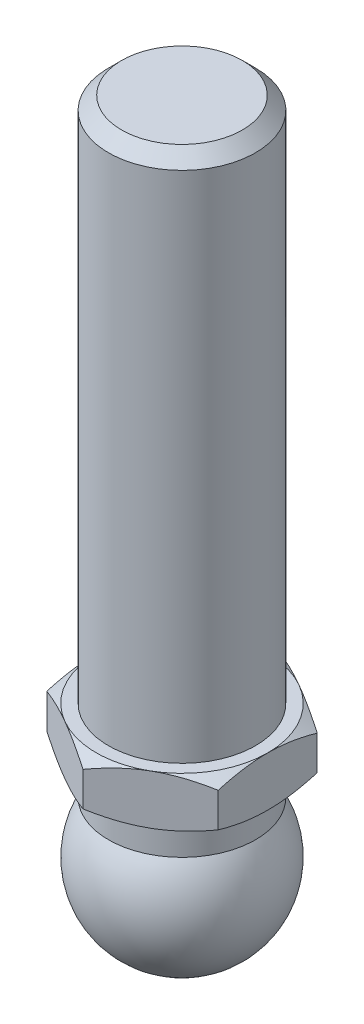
ISO-10303-21;
HEADER;
FILE_DESCRIPTION(('STEP AP214'),'2;1');
FILE_NAME('part.step','',(''),(''),'','','');
FILE_SCHEMA(('AUTOMOTIVE_DESIGN { 1 0 10303 214 1 1 1 1 }'));
ENDSEC;
DATA;
#1=APPLICATION_CONTEXT('core data for automotive mechanical design processes');
#2=APPLICATION_PROTOCOL_DEFINITION('international standard','automotive_design',2000,#1);
#3=PRODUCT_CONTEXT('',#1,'mechanical');
#4=PRODUCT('Part','Part','',(#3));
#5=PRODUCT_RELATED_PRODUCT_CATEGORY('part','',(#4));
#6=PRODUCT_DEFINITION_FORMATION('','',#4);
#7=PRODUCT_DEFINITION_CONTEXT('part definition',#1,'design');
#8=PRODUCT_DEFINITION('design','',#6,#7);
#9=PRODUCT_DEFINITION_SHAPE('','',#8);
#10=(LENGTH_UNIT() NAMED_UNIT(*) SI_UNIT(.MILLI.,.METRE.));
#11=(NAMED_UNIT(*) PLANE_ANGLE_UNIT() SI_UNIT($,.RADIAN.));
#12=(NAMED_UNIT(*) SI_UNIT($,.STERADIAN.) SOLID_ANGLE_UNIT());
#13=UNCERTAINTY_MEASURE_WITH_UNIT(LENGTH_MEASURE(1.E-05),#10,'distance_accuracy_value','');
#14=(GEOMETRIC_REPRESENTATION_CONTEXT(3) GLOBAL_UNCERTAINTY_ASSIGNED_CONTEXT((#13)) GLOBAL_UNIT_ASSIGNED_CONTEXT((#10,
#11,#12)) REPRESENTATION_CONTEXT('',''));
#15=CARTESIAN_POINT('',(0.,0.,0.));
#16=DIRECTION('',(0.,0.,1.));
#17=DIRECTION('',(1.,0.,0.));
#18=AXIS2_PLACEMENT_3D('',#15,#16,#17);
#19=CARTESIAN_POINT('',(0.,10.85,0.));
#20=DIRECTION('',(0.,-1.,0.));
#21=DIRECTION('',(0.,0.,-1.));
#22=AXIS2_PLACEMENT_3D('',#19,#20,#21);
#23=CONICAL_SURFACE('',#22,7.,1.0471975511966);
#24=CARTESIAN_POINT('',(-7.,6.78828268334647,12.1648696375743));
#25=CARTESIAN_POINT('',(-7.,6.93391573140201,11.8738003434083));
#26=CARTESIAN_POINT('',(-7.,7.07854589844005,11.5822239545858));
#27=CARTESIAN_POINT('',(-7.,7.36531569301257,10.997825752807));
#28=CARTESIAN_POINT('',(-7.,7.50745515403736,10.7050038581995));
#29=CARTESIAN_POINT('',(-7.,7.78902214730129,10.1173316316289));
#30=CARTESIAN_POINT('',(-7.,7.9284436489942,9.82247840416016));
#31=CARTESIAN_POINT('',(-7.,8.20360604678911,9.23106328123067));
#32=CARTESIAN_POINT('',(-7.,8.33934701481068,8.93450141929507));
#33=CARTESIAN_POINT('',(-7.,8.61231104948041,8.32593520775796));
#34=CARTESIAN_POINT('',(-7.,8.74932547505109,8.01383696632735));
#35=CARTESIAN_POINT('',(-7.,9.0171383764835,7.38695797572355));
#36=CARTESIAN_POINT('',(-7.,9.14793657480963,7.07217710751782));
#37=CARTESIAN_POINT('',(-7.,9.40155301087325,6.43962449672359));
#38=CARTESIAN_POINT('',(-7.,9.52437615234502,6.12185473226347));
#39=CARTESIAN_POINT('',(-7.,9.75990162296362,5.48260317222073));
#40=CARTESIAN_POINT('',(-7.,9.87260505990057,5.16112178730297));
#41=CARTESIAN_POINT('',(-7.,10.1099014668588,4.43821731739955));
#42=CARTESIAN_POINT('',(-7.,10.231118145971,4.03566892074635));
#43=CARTESIAN_POINT('',(-7.,10.4469740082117,3.22331060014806));
#44=CARTESIAN_POINT('',(-7.,10.5416155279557,2.81350131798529));
#45=CARTESIAN_POINT('',(-7.,10.6569999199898,2.1974256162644));
#46=CARTESIAN_POINT('',(-7.,10.6908518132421,1.99359214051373));
#47=CARTESIAN_POINT('',(-7.,10.7493191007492,1.5846161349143));
#48=CARTESIAN_POINT('',(-7.,10.7739358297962,1.37947379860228));
#49=CARTESIAN_POINT('',(-7.,10.8131968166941,0.968289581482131));
#50=CARTESIAN_POINT('',(-7.,10.8278439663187,0.762247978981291));
#51=CARTESIAN_POINT('',(-7.,10.8467021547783,0.34968332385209));
#52=CARTESIAN_POINT('',(-7.,10.8509132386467,0.143160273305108));
#53=CARTESIAN_POINT('',(-7.,10.8487493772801,-0.271082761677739));
#54=CARTESIAN_POINT('',(-7.,10.8423100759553,-0.478802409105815));
#55=CARTESIAN_POINT('',(-7.,10.8189433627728,-0.89364512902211));
#56=CARTESIAN_POINT('',(-7.,10.8020159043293,-1.10076819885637));
#57=CARTESIAN_POINT('',(-7.,10.7582124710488,-1.51403043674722));
#58=CARTESIAN_POINT('',(-7.,10.7313327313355,-1.72016920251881));
#59=CARTESIAN_POINT('',(-7.,10.6684180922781,-2.1310331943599));
#60=CARTESIAN_POINT('',(-7.,10.6323828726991,-2.33575837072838));
#61=CARTESIAN_POINT('',(-7.,10.5105686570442,-2.9543791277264));
#62=CARTESIAN_POINT('',(-7.,10.4118729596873,-3.36575077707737));
#63=CARTESIAN_POINT('',(-7.,10.18845338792,-4.18138012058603));
#64=CARTESIAN_POINT('',(-7.,10.0637148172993,-4.58563365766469));
#65=CARTESIAN_POINT('',(-7.,9.82332483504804,-5.30320893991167));
#66=CARTESIAN_POINT('',(-7.,9.71128759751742,-5.61775957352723));
#67=CARTESIAN_POINT('',(-7.,9.47785144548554,-6.24325021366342));
#68=CARTESIAN_POINT('',(-7.,9.35645511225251,-6.55419118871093));
#69=CARTESIAN_POINT('',(-7.,9.10620704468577,-7.17328528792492));
#70=CARTESIAN_POINT('',(-7.,8.97735033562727,-7.48143638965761));
#71=CARTESIAN_POINT('',(-7.,8.71378231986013,-8.09523802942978));
#72=CARTESIAN_POINT('',(-7.,8.57907065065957,-8.40088841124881));
#73=CARTESIAN_POINT('',(-7.,8.3107840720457,-8.99716345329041));
#74=CARTESIAN_POINT('',(-7.,8.1774031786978,-9.28787568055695));
#75=CARTESIAN_POINT('',(-7.,7.90714715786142,-9.86766295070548));
#76=CARTESIAN_POINT('',(-7.,7.77027208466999,-10.1567380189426));
#77=CARTESIAN_POINT('',(-7.,7.49389786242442,-10.7329937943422));
#78=CARTESIAN_POINT('',(-7.,7.35440383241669,-11.0201769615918));
#79=CARTESIAN_POINT('',(-7.,7.07302286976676,-11.5933594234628));
#80=CARTESIAN_POINT('',(-7.,6.93113600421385,-11.879358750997));
#81=CARTESIAN_POINT('',(-7.,6.78828268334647,-12.1648696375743));
#82=B_SPLINE_CURVE_WITH_KNOTS('',3,(#24,#25,#26,#27,#28,#29,#30,#31,#32,#33,#34,#35,#36,#37,#38,
#39,#40,#41,#42,#43,#44,#45,#46,#47,#48,#49,#50,#51,#52,#53,#54,#55,#56,#57,#58,#59,#60,#61,#62,
#63,#64,#65,#66,#67,#68,#69,#70,#71,#72,#73,#74,#75,#76,#77,#78,#79,#80,#81),.UNSPECIFIED.,.F.,
.F.,(4,2,2,2,2,2,2,2,2,2,2,2,2,2,2,2,2,2,2,2,2,2,2,2,2,2,2,2,4),(0.,0.976413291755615,
1.95289161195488,2.93133423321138,3.9097577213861,4.93225217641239,5.95479223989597,
6.97669748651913,7.99849072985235,9.25906449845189,10.519527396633,11.1392271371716,
11.7588372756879,12.3782676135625,12.9976952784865,13.6208795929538,14.2440666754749,
14.8674897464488,15.4909346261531,16.7587972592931,18.0273773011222,19.0289263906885,
20.0302002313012,21.0321496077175,22.0341611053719,22.9936838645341,23.9531917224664,
24.9109871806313,25.8687558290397),.UNSPECIFIED.);
#83=CARTESIAN_POINT('',(-7.,10.2247852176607,4.04145188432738));
#84=VERTEX_POINT('',#83);
#85=CARTESIAN_POINT('',(-7.,10.85,0.));
#86=VERTEX_POINT('',#85);
#87=EDGE_CURVE('E316',#84,#86,#82,.T.);
#88=ORIENTED_EDGE('',*,*,#87,.F.);
#89=CARTESIAN_POINT('',(0.000200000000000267,10.2247185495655,8.0830192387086));
#90=CARTESIAN_POINT('',(-0.153667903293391,10.2760001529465,7.99418356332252));
#91=CARTESIAN_POINT('',(-0.308109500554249,10.3249544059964,7.90501666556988));
#92=CARTESIAN_POINT('',(-0.618246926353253,10.4175672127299,7.72595873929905));
#93=CARTESIAN_POINT('',(-0.773943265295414,10.4612234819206,7.63606741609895));
#94=CARTESIAN_POINT('',(-1.24352516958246,10.5833884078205,7.36495417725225));
#95=CARTESIAN_POINT('',(-1.5592643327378,10.6528744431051,7.18266208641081));
#96=CARTESIAN_POINT('',(-2.03176224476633,10.7343550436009,6.9098652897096));
#97=CARTESIAN_POINT('',(-2.18710922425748,10.7575665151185,6.82017566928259));
#98=CARTESIAN_POINT('',(-2.49850511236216,10.7964887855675,6.64039116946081));
#99=CARTESIAN_POINT('',(-2.6545539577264,10.8122002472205,6.55029632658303));
#100=CARTESIAN_POINT('',(-2.96692267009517,10.8357220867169,6.36995016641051));
#101=CARTESIAN_POINT('',(-3.12324202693,10.8435414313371,6.27969914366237));
#102=CARTESIAN_POINT('',(-3.43601650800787,10.8511197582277,6.09911871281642));
#103=CARTESIAN_POINT('',(-3.59247162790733,10.850878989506,6.00878930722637));
#104=CARTESIAN_POINT('',(-4.02110687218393,10.8391402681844,5.76131663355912));
#105=CARTESIAN_POINT('',(-4.2931466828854,10.8194342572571,5.60425437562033));
#106=CARTESIAN_POINT('',(-4.83541944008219,10.7569465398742,5.29117305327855));
#107=CARTESIAN_POINT('',(-5.10565047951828,10.714143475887,5.13515508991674));
#108=CARTESIAN_POINT('',(-5.64901454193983,10.6071483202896,4.82144370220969));
#109=CARTESIAN_POINT('',(-5.92207900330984,10.5425029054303,4.66378986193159));
#110=CARTESIAN_POINT('',(-6.46413578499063,10.395783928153,4.35083323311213));
#111=CARTESIAN_POINT('',(-6.73313504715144,10.3137448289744,4.19552643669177));
#112=CARTESIAN_POINT('',(-7.0002,10.2247185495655,4.04133641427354));
#113=B_SPLINE_CURVE_WITH_KNOTS('',3,(#89,#90,#91,#92,#93,#94,#95,#96,#97,#98,#99,#100,#101,#102,
#103,#104,#105,#106,#107,#108,#109,#110,#111,#112),.UNSPECIFIED.,.F.,.F.,(4,2,2,2,2,2,2,2,2,2,2,
4),(0.,0.554727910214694,1.10969417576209,2.2219327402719,2.76443041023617,3.30688013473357,
3.8487128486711,4.39052882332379,5.33376515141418,6.27787517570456,7.2429241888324,
8.20607866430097),.UNSPECIFIED.);
#114=CARTESIAN_POINT('',(-3.5,10.85,6.06217782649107));
#115=VERTEX_POINT('',#114);
#116=EDGE_CURVE('E138',#115,#84,#113,.T.);
#117=ORIENTED_EDGE('',*,*,#116,.F.);
#118=CARTESIAN_POINT('',(0.,10.85,0.));
#119=DIRECTION('',(0.,-1.,0.));
#120=DIRECTION('',(0.,0.,-1.));
#121=AXIS2_PLACEMENT_3D('',#118,#119,#120);
#122=CIRCLE('',#121,7.);
#123=EDGE_CURVE('E286',#115,#86,#122,.T.);
#124=ORIENTED_EDGE('',*,*,#123,.T.);
#125=EDGE_LOOP('',(#88,#117,#124));
#126=FACE_BOUND('',#125,.T.);
#127=ADVANCED_FACE('F17',(#126),#23,.T.);
#128=CARTESIAN_POINT('',(-7.,10.2247852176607,-4.04145188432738));
#129=VERTEX_POINT('',#128);
#130=EDGE_CURVE('E196',#86,#129,#82,.T.);
#131=ORIENTED_EDGE('',*,*,#130,.F.);
#132=CARTESIAN_POINT('',(-3.5,10.85,-6.06217782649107));
#133=VERTEX_POINT('',#132);
#134=EDGE_CURVE('E198',#86,#133,#122,.T.);
#135=ORIENTED_EDGE('',*,*,#134,.T.);
#136=CARTESIAN_POINT('',(-7.0002,10.2247185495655,-4.04133641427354));
#137=CARTESIAN_POINT('',(-6.84633209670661,10.2760001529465,-4.13017208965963));
#138=CARTESIAN_POINT('',(-6.69189049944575,10.3249544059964,-4.21933898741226));
#139=CARTESIAN_POINT('',(-6.38175307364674,10.4175672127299,-4.39839691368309));
#140=CARTESIAN_POINT('',(-6.22605673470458,10.4612234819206,-4.48828823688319));
#141=CARTESIAN_POINT('',(-5.75647483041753,10.5833884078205,-4.75940147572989));
#142=CARTESIAN_POINT('',(-5.4407356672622,10.652874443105,-4.94169356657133));
#143=CARTESIAN_POINT('',(-4.96823775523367,10.7343550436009,-5.21449036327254));
#144=CARTESIAN_POINT('',(-4.81289077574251,10.7575665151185,-5.30417998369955));
#145=CARTESIAN_POINT('',(-4.50149488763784,10.7964887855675,-5.48396448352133));
#146=CARTESIAN_POINT('',(-4.34544604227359,10.8122002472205,-5.57405932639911));
#147=CARTESIAN_POINT('',(-4.03307732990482,10.8357220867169,-5.75440548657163));
#148=CARTESIAN_POINT('',(-3.87675797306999,10.8435414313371,-5.84465650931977));
#149=CARTESIAN_POINT('',(-3.56398349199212,10.8511197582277,-6.02523694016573));
#150=CARTESIAN_POINT('',(-3.40752837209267,10.850878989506,-6.11556634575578));
#151=CARTESIAN_POINT('',(-2.97889312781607,10.8391402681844,-6.36303901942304));
#152=CARTESIAN_POINT('',(-2.7068533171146,10.8194342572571,-6.52010127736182));
#153=CARTESIAN_POINT('',(-2.1645805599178,10.7569465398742,-6.83318259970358));
#154=CARTESIAN_POINT('',(-1.89434952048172,10.714143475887,-6.9892005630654));
#155=CARTESIAN_POINT('',(-1.35098545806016,10.6071483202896,-7.30291195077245));
#156=CARTESIAN_POINT('',(-1.07792099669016,10.5425029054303,-7.46056579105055));
#157=CARTESIAN_POINT('',(-0.53586421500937,10.395783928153,-7.77352241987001));
#158=CARTESIAN_POINT('',(-0.266864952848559,10.3137448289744,-7.92882921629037));
#159=CARTESIAN_POINT('',(0.000200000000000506,10.2247185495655,-8.0830192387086));
#160=B_SPLINE_CURVE_WITH_KNOTS('',3,(#136,#137,#138,#139,#140,#141,#142,#143,#144,#145,#146,
#147,#148,#149,#150,#151,#152,#153,#154,#155,#156,#157,#158,#159),.UNSPECIFIED.,.F.,.F.,(4,2,2,
2,2,2,2,2,2,2,2,4),(0.,0.554727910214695,1.10969417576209,2.2219327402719,2.76443041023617,
3.30688013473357,3.8487128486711,4.39052882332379,5.33376515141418,6.27787517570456,
7.2429241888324,8.20607866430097),.UNSPECIFIED.);
#161=EDGE_CURVE('E186',#129,#133,#160,.T.);
#162=ORIENTED_EDGE('',*,*,#161,.F.);
#163=EDGE_LOOP('',(#131,#135,#162));
#164=FACE_BOUND('',#163,.T.);
#165=ADVANCED_FACE('F195',(#164),#23,.T.);
#166=CARTESIAN_POINT('',(0.,10.2247852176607,-8.08290376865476));
#167=VERTEX_POINT('',#166);
#168=EDGE_CURVE('E200',#133,#167,#160,.T.);
#169=ORIENTED_EDGE('',*,*,#168,.F.);
#170=CARTESIAN_POINT('',(3.5,10.85,-6.06217782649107));
#171=VERTEX_POINT('',#170);
#172=EDGE_CURVE('E296',#133,#171,#122,.T.);
#173=ORIENTED_EDGE('',*,*,#172,.T.);
#174=CARTESIAN_POINT('',(-0.000200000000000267,10.2247185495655,-8.0830192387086));
#175=CARTESIAN_POINT('',(0.153667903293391,10.2760001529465,-7.99418356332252));
#176=CARTESIAN_POINT('',(0.308109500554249,10.3249544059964,-7.90501666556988));
#177=CARTESIAN_POINT('',(0.618246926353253,10.4175672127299,-7.72595873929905));
#178=CARTESIAN_POINT('',(0.773943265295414,10.4612234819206,-7.63606741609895));
#179=CARTESIAN_POINT('',(1.24352516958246,10.5833884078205,-7.36495417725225));
#180=CARTESIAN_POINT('',(1.5592643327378,10.6528744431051,-7.18266208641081));
#181=CARTESIAN_POINT('',(2.03176224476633,10.7343550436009,-6.9098652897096));
#182=CARTESIAN_POINT('',(2.18710922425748,10.7575665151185,-6.82017566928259));
#183=CARTESIAN_POINT('',(2.49850511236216,10.7964887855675,-6.64039116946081));
#184=CARTESIAN_POINT('',(2.6545539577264,10.8122002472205,-6.55029632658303));
#185=CARTESIAN_POINT('',(2.96692267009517,10.8357220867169,-6.36995016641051));
#186=CARTESIAN_POINT('',(3.12324202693,10.8435414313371,-6.27969914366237));
#187=CARTESIAN_POINT('',(3.43601650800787,10.8511197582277,-6.09911871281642));
#188=CARTESIAN_POINT('',(3.59247162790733,10.850878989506,-6.00878930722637));
#189=CARTESIAN_POINT('',(4.02110687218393,10.8391402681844,-5.76131663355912));
#190=CARTESIAN_POINT('',(4.2931466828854,10.8194342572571,-5.60425437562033));
#191=CARTESIAN_POINT('',(4.83541944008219,10.7569465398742,-5.29117305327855));
#192=CARTESIAN_POINT('',(5.10565047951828,10.714143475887,-5.13515508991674));
#193=CARTESIAN_POINT('',(5.64901454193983,10.6071483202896,-4.82144370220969));
#194=CARTESIAN_POINT('',(5.92207900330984,10.5425029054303,-4.66378986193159));
#195=CARTESIAN_POINT('',(6.46413578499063,10.395783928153,-4.35083323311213));
#196=CARTESIAN_POINT('',(6.73313504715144,10.3137448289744,-4.19552643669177));
#197=CARTESIAN_POINT('',(7.0002,10.2247185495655,-4.04133641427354));
#198=B_SPLINE_CURVE_WITH_KNOTS('',3,(#174,#175,#176,#177,#178,#179,#180,#181,#182,#183,#184,
#185,#186,#187,#188,#189,#190,#191,#192,#193,#194,#195,#196,#197),.UNSPECIFIED.,.F.,.F.,(4,2,2,
2,2,2,2,2,2,2,2,4),(0.,0.554727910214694,1.10969417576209,2.2219327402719,2.76443041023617,
3.30688013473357,3.8487128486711,4.39052882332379,5.33376515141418,6.27787517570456,
7.2429241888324,8.20607866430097),.UNSPECIFIED.);
#199=EDGE_CURVE('E246',#167,#171,#198,.T.);
#200=ORIENTED_EDGE('',*,*,#199,.F.);
#201=EDGE_LOOP('',(#169,#173,#200));
#202=FACE_BOUND('',#201,.T.);
#203=ADVANCED_FACE('F349',(#202),#23,.T.);
#204=CARTESIAN_POINT('',(7.,10.2247852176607,-4.04145188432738));
#205=VERTEX_POINT('',#204);
#206=EDGE_CURVE('E241',#171,#205,#198,.T.);
#207=ORIENTED_EDGE('',*,*,#206,.F.);
#208=CARTESIAN_POINT('',(7.,10.85,0.));
#209=VERTEX_POINT('',#208);
#210=EDGE_CURVE('E291',#171,#209,#122,.T.);
#211=ORIENTED_EDGE('',*,*,#210,.T.);
#212=CARTESIAN_POINT('',(7.,6.78828268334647,-12.1648696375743));
#213=CARTESIAN_POINT('',(7.,6.93391573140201,-11.8738003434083));
#214=CARTESIAN_POINT('',(7.,7.07854589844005,-11.5822239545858));
#215=CARTESIAN_POINT('',(7.,7.36531569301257,-10.997825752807));
#216=CARTESIAN_POINT('',(7.,7.50745515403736,-10.7050038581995));
#217=CARTESIAN_POINT('',(7.,7.78902214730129,-10.1173316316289));
#218=CARTESIAN_POINT('',(7.,7.9284436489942,-9.82247840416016));
#219=CARTESIAN_POINT('',(7.,8.20360604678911,-9.23106328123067));
#220=CARTESIAN_POINT('',(7.,8.33934701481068,-8.93450141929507));
#221=CARTESIAN_POINT('',(7.,8.61231104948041,-8.32593520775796));
#222=CARTESIAN_POINT('',(7.,8.74932547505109,-8.01383696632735));
#223=CARTESIAN_POINT('',(7.,9.0171383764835,-7.38695797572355));
#224=CARTESIAN_POINT('',(7.,9.14793657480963,-7.07217710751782));
#225=CARTESIAN_POINT('',(7.,9.40155301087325,-6.43962449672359));
#226=CARTESIAN_POINT('',(7.,9.52437615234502,-6.12185473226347));
#227=CARTESIAN_POINT('',(7.,9.75990162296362,-5.48260317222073));
#228=CARTESIAN_POINT('',(7.,9.87260505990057,-5.16112178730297));
#229=CARTESIAN_POINT('',(7.,10.1099014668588,-4.43821731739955));
#230=CARTESIAN_POINT('',(7.,10.231118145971,-4.03566892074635));
#231=CARTESIAN_POINT('',(7.,10.4469740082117,-3.22331060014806));
#232=CARTESIAN_POINT('',(7.,10.5416155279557,-2.81350131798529));
#233=CARTESIAN_POINT('',(7.,10.6569999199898,-2.1974256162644));
#234=CARTESIAN_POINT('',(7.,10.6908518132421,-1.99359214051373));
#235=CARTESIAN_POINT('',(7.,10.7493191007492,-1.5846161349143));
#236=CARTESIAN_POINT('',(7.,10.7739358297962,-1.37947379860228));
#237=CARTESIAN_POINT('',(7.,10.8131968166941,-0.968289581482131));
#238=CARTESIAN_POINT('',(7.,10.8278439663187,-0.762247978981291));
#239=CARTESIAN_POINT('',(7.,10.8467021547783,-0.34968332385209));
#240=CARTESIAN_POINT('',(7.,10.8509132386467,-0.143160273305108));
#241=CARTESIAN_POINT('',(7.,10.8487493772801,0.271082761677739));
#242=CARTESIAN_POINT('',(7.,10.8423100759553,0.478802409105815));
#243=CARTESIAN_POINT('',(7.,10.8189433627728,0.89364512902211));
#244=CARTESIAN_POINT('',(7.,10.8020159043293,1.10076819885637));
#245=CARTESIAN_POINT('',(7.,10.7582124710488,1.51403043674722));
#246=CARTESIAN_POINT('',(7.,10.7313327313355,1.72016920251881));
#247=CARTESIAN_POINT('',(7.,10.6684180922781,2.1310331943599));
#248=CARTESIAN_POINT('',(7.,10.6323828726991,2.33575837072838));
#249=CARTESIAN_POINT('',(7.,10.5105686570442,2.9543791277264));
#250=CARTESIAN_POINT('',(7.,10.4118729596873,3.36575077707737));
#251=CARTESIAN_POINT('',(7.,10.18845338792,4.18138012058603));
#252=CARTESIAN_POINT('',(7.,10.0637148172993,4.58563365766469));
#253=CARTESIAN_POINT('',(7.,9.82332483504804,5.30320893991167));
#254=CARTESIAN_POINT('',(7.,9.71128759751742,5.61775957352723));
#255=CARTESIAN_POINT('',(7.,9.47785144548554,6.24325021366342));
#256=CARTESIAN_POINT('',(7.,9.35645511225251,6.55419118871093));
#257=CARTESIAN_POINT('',(7.,9.10620704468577,7.17328528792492));
#258=CARTESIAN_POINT('',(7.,8.97735033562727,7.48143638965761));
#259=CARTESIAN_POINT('',(7.,8.71378231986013,8.09523802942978));
#260=CARTESIAN_POINT('',(7.,8.57907065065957,8.40088841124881));
#261=CARTESIAN_POINT('',(7.,8.3107840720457,8.99716345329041));
#262=CARTESIAN_POINT('',(7.,8.1774031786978,9.28787568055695));
#263=CARTESIAN_POINT('',(7.,7.90714715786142,9.86766295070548));
#264=CARTESIAN_POINT('',(7.,7.77027208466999,10.1567380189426));
#265=CARTESIAN_POINT('',(7.,7.49389786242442,10.7329937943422));
#266=CARTESIAN_POINT('',(7.,7.35440383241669,11.0201769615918));
#267=CARTESIAN_POINT('',(7.,7.07302286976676,11.5933594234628));
#268=CARTESIAN_POINT('',(7.,6.93113600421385,11.879358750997));
#269=CARTESIAN_POINT('',(7.,6.78828268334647,12.1648696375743));
#270=B_SPLINE_CURVE_WITH_KNOTS('',3,(#212,#213,#214,#215,#216,#217,#218,#219,#220,#221,#222,
#223,#224,#225,#226,#227,#228,#229,#230,#231,#232,#233,#234,#235,#236,#237,#238,#239,#240,#241,
#242,#243,#244,#245,#246,#247,#248,#249,#250,#251,#252,#253,#254,#255,#256,#257,#258,#259,#260,
#261,#262,#263,#264,#265,#266,#267,#268,#269),.UNSPECIFIED.,.F.,.F.,(4,2,2,2,2,2,2,2,2,2,2,2,2,
2,2,2,2,2,2,2,2,2,2,2,2,2,2,2,4),(0.,0.976413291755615,1.95289161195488,2.93133423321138,
3.9097577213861,4.93225217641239,5.95479223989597,6.97669748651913,7.99849072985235,
9.25906449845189,10.519527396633,11.1392271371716,11.7588372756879,12.3782676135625,
12.9976952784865,13.6208795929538,14.2440666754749,14.8674897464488,15.4909346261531,
16.7587972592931,18.0273773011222,19.0289263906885,20.0302002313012,21.0321496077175,
22.0341611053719,22.9936838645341,23.9531917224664,24.9109871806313,25.8687558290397),.UNSPECIFIED.);
#271=EDGE_CURVE('E252',#205,#209,#270,.T.);
#272=ORIENTED_EDGE('',*,*,#271,.F.);
#273=EDGE_LOOP('',(#207,#211,#272));
#274=FACE_BOUND('',#273,.T.);
#275=ADVANCED_FACE('F359',(#274),#23,.T.);
#276=CARTESIAN_POINT('',(7.,10.2247852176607,4.04145188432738));
#277=VERTEX_POINT('',#276);
#278=EDGE_CURVE('E254',#209,#277,#270,.T.);
#279=ORIENTED_EDGE('',*,*,#278,.F.);
#280=CARTESIAN_POINT('',(3.5,10.85,6.06217782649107));
#281=VERTEX_POINT('',#280);
#282=EDGE_CURVE('E284',#209,#281,#122,.T.);
#283=ORIENTED_EDGE('',*,*,#282,.T.);
#284=CARTESIAN_POINT('',(7.0002,10.2247185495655,4.04133641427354));
#285=CARTESIAN_POINT('',(6.84633209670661,10.2760001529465,4.13017208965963));
#286=CARTESIAN_POINT('',(6.69189049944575,10.3249544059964,4.21933898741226));
#287=CARTESIAN_POINT('',(6.38175307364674,10.4175672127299,4.39839691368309));
#288=CARTESIAN_POINT('',(6.22605673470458,10.4612234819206,4.48828823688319));
#289=CARTESIAN_POINT('',(5.75647483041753,10.5833884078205,4.75940147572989));
#290=CARTESIAN_POINT('',(5.4407356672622,10.652874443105,4.94169356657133));
#291=CARTESIAN_POINT('',(4.96823775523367,10.7343550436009,5.21449036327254));
#292=CARTESIAN_POINT('',(4.81289077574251,10.7575665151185,5.30417998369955));
#293=CARTESIAN_POINT('',(4.50149488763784,10.7964887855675,5.48396448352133));
#294=CARTESIAN_POINT('',(4.34544604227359,10.8122002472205,5.57405932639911));
#295=CARTESIAN_POINT('',(4.03307732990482,10.8357220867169,5.75440548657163));
#296=CARTESIAN_POINT('',(3.87675797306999,10.8435414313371,5.84465650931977));
#297=CARTESIAN_POINT('',(3.56398349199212,10.8511197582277,6.02523694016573));
#298=CARTESIAN_POINT('',(3.40752837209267,10.850878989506,6.11556634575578));
#299=CARTESIAN_POINT('',(2.97889312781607,10.8391402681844,6.36303901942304));
#300=CARTESIAN_POINT('',(2.7068533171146,10.8194342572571,6.52010127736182));
#301=CARTESIAN_POINT('',(2.1645805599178,10.7569465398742,6.83318259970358));
#302=CARTESIAN_POINT('',(1.89434952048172,10.714143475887,6.9892005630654));
#303=CARTESIAN_POINT('',(1.35098545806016,10.6071483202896,7.30291195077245));
#304=CARTESIAN_POINT('',(1.07792099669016,10.5425029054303,7.46056579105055));
#305=CARTESIAN_POINT('',(0.53586421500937,10.395783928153,7.77352241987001));
#306=CARTESIAN_POINT('',(0.266864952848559,10.3137448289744,7.92882921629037));
#307=CARTESIAN_POINT('',(-0.000200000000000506,10.2247185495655,8.0830192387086));
#308=B_SPLINE_CURVE_WITH_KNOTS('',3,(#284,#285,#286,#287,#288,#289,#290,#291,#292,#293,#294,
#295,#296,#297,#298,#299,#300,#301,#302,#303,#304,#305,#306,#307),.UNSPECIFIED.,.F.,.F.,(4,2,2,
2,2,2,2,2,2,2,2,4),(0.,0.554727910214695,1.10969417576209,2.2219327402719,2.76443041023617,
3.30688013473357,3.8487128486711,4.39052882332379,5.33376515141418,6.27787517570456,
7.2429241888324,8.20607866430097),.UNSPECIFIED.);
#309=EDGE_CURVE('E129',#277,#281,#308,.T.);
#310=ORIENTED_EDGE('',*,*,#309,.F.);
#311=EDGE_LOOP('',(#279,#283,#310));
#312=FACE_BOUND('',#311,.T.);
#313=ADVANCED_FACE('F288',(#312),#23,.T.);
#314=CARTESIAN_POINT('',(0.,10.2247852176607,8.08290376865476));
#315=VERTEX_POINT('',#314);
#316=EDGE_CURVE('E119',#281,#315,#308,.T.);
#317=ORIENTED_EDGE('',*,*,#316,.F.);
#318=EDGE_CURVE('E277',#281,#115,#122,.T.);
#319=ORIENTED_EDGE('',*,*,#318,.T.);
#320=EDGE_CURVE('E32',#315,#115,#113,.T.);
#321=ORIENTED_EDGE('',*,*,#320,.F.);
#322=EDGE_LOOP('',(#317,#319,#321));
#323=FACE_BOUND('',#322,.T.);
#324=ADVANCED_FACE('F276',(#323),#23,.T.);
#325=CARTESIAN_POINT('',(0.,53.85,0.));
#326=DIRECTION('',(0.,-1.,0.));
#327=DIRECTION('',(0.,0.,-1.));
#328=AXIS2_PLACEMENT_3D('',#325,#326,#327);
#329=PLANE('',#328);
#330=CARTESIAN_POINT('',(0.,53.85,0.));
#331=DIRECTION('',(0.,-1.,0.));
#332=DIRECTION('',(0.,0.,-1.));
#333=AXIS2_PLACEMENT_3D('',#330,#331,#332);
#334=CIRCLE('',#333,4.9265);
#335=CARTESIAN_POINT('',(0.,53.85,-4.9265));
#336=VERTEX_POINT('',#335);
#337=EDGE_CURVE('E25',#336,#336,#334,.T.);
#338=ORIENTED_EDGE('',*,*,#337,.F.);
#339=EDGE_LOOP('',(#338));
#340=FACE_BOUND('',#339,.T.);
#341=ADVANCED_FACE('F19',(#340),#329,.F.);
#342=CARTESIAN_POINT('',(0.,53.85,0.));
#343=DIRECTION('',(0.,-1.,0.));
#344=DIRECTION('',(0.,0.,-1.));
#345=AXIS2_PLACEMENT_3D('',#342,#343,#344);
#346=CONICAL_SURFACE('',#345,4.9265,0.785398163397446);
#347=CARTESIAN_POINT('',(0.,52.7765,0.));
#348=DIRECTION('',(0.,-1.,0.));
#349=DIRECTION('',(0.,0.,-1.));
#350=AXIS2_PLACEMENT_3D('',#347,#348,#349);
#351=CIRCLE('',#350,6.);
#352=CARTESIAN_POINT('',(0.,52.7765,-6.));
#353=VERTEX_POINT('',#352);
#354=EDGE_CURVE('E293',#353,#353,#351,.T.);
#355=ORIENTED_EDGE('',*,*,#354,.F.);
#356=EDGE_LOOP('',(#355));
#357=FACE_BOUND('',#356,.T.);
#358=ORIENTED_EDGE('',*,*,#337,.T.);
#359=EDGE_LOOP('',(#358));
#360=FACE_BOUND('',#359,.T.);
#361=ADVANCED_FACE('F357',(#357,#360),#346,.T.);
#362=CARTESIAN_POINT('',(0.,-7.,0.));
#363=DIRECTION('',(0.,-1.,0.));
#364=DIRECTION('',(0.,0.,-1.));
#365=AXIS2_PLACEMENT_3D('',#362,#363,#364);
#366=CYLINDRICAL_SURFACE('',#365,6.);
#367=CARTESIAN_POINT('',(0.,10.85,0.));
#368=DIRECTION('',(0.,-1.,0.));
#369=DIRECTION('',(0.,0.,-1.));
#370=AXIS2_PLACEMENT_3D('',#367,#368,#369);
#371=CIRCLE('',#370,6.);
#372=CARTESIAN_POINT('',(0.,10.85,-6.));
#373=VERTEX_POINT('',#372);
#374=EDGE_CURVE('E290',#373,#373,#371,.T.);
#375=ORIENTED_EDGE('',*,*,#374,.F.);
#376=EDGE_LOOP('',(#375));
#377=FACE_BOUND('',#376,.T.);
#378=ORIENTED_EDGE('',*,*,#354,.T.);
#379=EDGE_LOOP('',(#378));
#380=FACE_BOUND('',#379,.T.);
#381=ADVANCED_FACE('F442',(#377,#380),#366,.T.);
#382=CARTESIAN_POINT('',(6.,10.85,0.));
#383=DIRECTION('',(0.,-1.,0.));
#384=DIRECTION('',(0.,0.,-1.));
#385=AXIS2_PLACEMENT_3D('',#382,#383,#384);
#386=PLANE('',#385);
#387=ORIENTED_EDGE('',*,*,#282,.F.);
#388=ORIENTED_EDGE('',*,*,#210,.F.);
#389=ORIENTED_EDGE('',*,*,#172,.F.);
#390=ORIENTED_EDGE('',*,*,#134,.F.);
#391=ORIENTED_EDGE('',*,*,#123,.F.);
#392=ORIENTED_EDGE('',*,*,#318,.F.);
#393=EDGE_LOOP('',(#387,#388,#389,#390,#391,#392));
#394=FACE_BOUND('',#393,.T.);
#395=ORIENTED_EDGE('',*,*,#374,.T.);
#396=EDGE_LOOP('',(#395));
#397=FACE_BOUND('',#396,.T.);
#398=ADVANCED_FACE('F281',(#394,#397),#386,.F.);
#399=CARTESIAN_POINT('',(-7.,6.8,-4.04145188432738));
#400=DIRECTION('',(-1.,0.,0.));
#401=DIRECTION('',(0.,0.,1.));
#402=AXIS2_PLACEMENT_3D('',#399,#400,#401);
#403=PLANE('',#402);
#404=ORIENTED_EDGE('',*,*,#87,.T.);
#405=ORIENTED_EDGE('',*,*,#130,.T.);
#406=DIRECTION('',(0.,1.,0.));
#407=VECTOR('',#406,1.);
#408=CARTESIAN_POINT('',(-7.,6.8,-4.04145188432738));
#409=LINE('',#408,#407);
#410=CARTESIAN_POINT('',(-7.,7.4252147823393,-4.04145188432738));
#411=VERTEX_POINT('',#410);
#412=EDGE_CURVE('E112',#411,#129,#409,.T.);
#413=ORIENTED_EDGE('',*,*,#412,.F.);
#414=CARTESIAN_POINT('',(-7.,10.8617173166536,-12.1648696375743));
#415=CARTESIAN_POINT('',(-7.,10.716084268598,-11.8738003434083));
#416=CARTESIAN_POINT('',(-7.,10.57145410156,-11.5822239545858));
#417=CARTESIAN_POINT('',(-7.,10.2846843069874,-10.997825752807));
#418=CARTESIAN_POINT('',(-7.,10.1425448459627,-10.7050038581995));
#419=CARTESIAN_POINT('',(-7.,9.86097785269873,-10.1173316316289));
#420=CARTESIAN_POINT('',(-7.,9.72155635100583,-9.82247840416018));
#421=CARTESIAN_POINT('',(-7.,9.44639395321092,-9.23106328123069));
#422=CARTESIAN_POINT('',(-7.,9.31065298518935,-8.93450141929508));
#423=CARTESIAN_POINT('',(-7.,9.03768895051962,-8.32593520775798));
#424=CARTESIAN_POINT('',(-7.,8.90067452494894,-8.01383696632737));
#425=CARTESIAN_POINT('',(-7.,8.63286162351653,-7.38695797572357));
#426=CARTESIAN_POINT('',(-7.,8.5020634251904,-7.07217710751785));
#427=CARTESIAN_POINT('',(-7.,8.24844698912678,-6.43962449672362));
#428=CARTESIAN_POINT('',(-7.,8.12562384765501,-6.1218547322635));
#429=CARTESIAN_POINT('',(-7.,7.8900983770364,-5.48260317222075));
#430=CARTESIAN_POINT('',(-7.,7.77739494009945,-5.161121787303));
#431=CARTESIAN_POINT('',(-7.,7.54009853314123,-4.43821731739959));
#432=CARTESIAN_POINT('',(-7.,7.41888185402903,-4.03566892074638));
#433=CARTESIAN_POINT('',(-7.,7.20302599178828,-3.2233106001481));
#434=CARTESIAN_POINT('',(-7.,7.10838447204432,-2.81350131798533));
#435=CARTESIAN_POINT('',(-7.,6.99300008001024,-2.19742561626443));
#436=CARTESIAN_POINT('',(-7.,6.95914818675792,-1.99359214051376));
#437=CARTESIAN_POINT('',(-7.,6.90068089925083,-1.58461613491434));
#438=CARTESIAN_POINT('',(-7.,6.87606417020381,-1.37947379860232));
#439=CARTESIAN_POINT('',(-7.,6.83680318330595,-0.968289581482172));
#440=CARTESIAN_POINT('',(-7.,6.82215603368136,-0.762247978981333));
#441=CARTESIAN_POINT('',(-7.,6.80329784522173,-0.349683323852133));
#442=CARTESIAN_POINT('',(-7.,6.79908676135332,-0.143160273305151));
#443=CARTESIAN_POINT('',(-7.,6.80125062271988,0.271082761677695));
#444=CARTESIAN_POINT('',(-7.,6.80768992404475,0.47880240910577));
#445=CARTESIAN_POINT('',(-7.,6.83105663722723,0.893645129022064));
#446=CARTESIAN_POINT('',(-7.,6.84798409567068,1.10076819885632));
#447=CARTESIAN_POINT('',(-7.,6.89178752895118,1.51403043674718));
#448=CARTESIAN_POINT('',(-7.,6.91866726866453,1.72016920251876));
#449=CARTESIAN_POINT('',(-7.,6.9815819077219,2.13103319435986));
#450=CARTESIAN_POINT('',(-7.,7.01761712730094,2.33575837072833));
#451=CARTESIAN_POINT('',(-7.,7.13943134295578,2.95437912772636));
#452=CARTESIAN_POINT('',(-7.,7.2381270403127,3.36575077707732));
#453=CARTESIAN_POINT('',(-7.,7.46154661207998,4.18138012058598));
#454=CARTESIAN_POINT('',(-7.,7.58628518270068,4.58563365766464));
#455=CARTESIAN_POINT('',(-7.,7.82667516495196,5.30320893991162));
#456=CARTESIAN_POINT('',(-7.,7.93871240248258,5.61775957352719));
#457=CARTESIAN_POINT('',(-7.,8.17214855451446,6.24325021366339));
#458=CARTESIAN_POINT('',(-7.,8.29354488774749,6.55419118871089));
#459=CARTESIAN_POINT('',(-7.,8.54379295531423,7.17328528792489));
#460=CARTESIAN_POINT('',(-7.,8.67264966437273,7.48143638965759));
#461=CARTESIAN_POINT('',(-7.,8.93621768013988,8.09523802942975));
#462=CARTESIAN_POINT('',(-7.,9.07092934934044,8.40088841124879));
#463=CARTESIAN_POINT('',(-7.,9.3392159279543,8.99716345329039));
#464=CARTESIAN_POINT('',(-7.,9.47259682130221,9.28787568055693));
#465=CARTESIAN_POINT('',(-7.,9.74285284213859,9.86766295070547));
#466=CARTESIAN_POINT('',(-7.,9.87972791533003,10.1567380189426));
#467=CARTESIAN_POINT('',(-7.,10.1561021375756,10.7329937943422));
#468=CARTESIAN_POINT('',(-7.,10.2955961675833,11.0201769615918));
#469=CARTESIAN_POINT('',(-7.,10.5769771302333,11.5933594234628));
#470=CARTESIAN_POINT('',(-7.,10.7188639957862,11.879358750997));
#471=CARTESIAN_POINT('',(-7.,10.8617173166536,12.1648696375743));
#472=B_SPLINE_CURVE_WITH_KNOTS('',3,(#414,#415,#416,#417,#418,#419,#420,#421,#422,#423,#424,
#425,#426,#427,#428,#429,#430,#431,#432,#433,#434,#435,#436,#437,#438,#439,#440,#441,#442,#443,
#444,#445,#446,#447,#448,#449,#450,#451,#452,#453,#454,#455,#456,#457,#458,#459,#460,#461,#462,
#463,#464,#465,#466,#467,#468,#469,#470,#471),.UNSPECIFIED.,.F.,.F.,(4,2,2,2,2,2,2,2,2,2,2,2,2,
2,2,2,2,2,2,2,2,2,2,2,2,2,2,2,4),(0.,0.976413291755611,1.95289161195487,2.93133423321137,
3.90975772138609,4.93225217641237,5.95479223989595,6.97669748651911,7.99849072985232,
9.25906449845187,10.5195273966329,11.1392271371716,11.7588372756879,12.3782676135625,
12.9976952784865,13.6208795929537,14.2440666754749,14.8674897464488,15.4909346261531,
16.758797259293,18.0273773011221,19.0289263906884,20.0302002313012,21.0321496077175,
22.0341611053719,22.9936838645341,23.9531917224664,24.9109871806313,25.8687558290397),.UNSPECIFIED.);
#473=CARTESIAN_POINT('',(-7.,6.8,0.));
#474=VERTEX_POINT('',#473);
#475=EDGE_CURVE('E202',#411,#474,#472,.T.);
#476=ORIENTED_EDGE('',*,*,#475,.T.);
#477=CARTESIAN_POINT('',(-7.,7.4252147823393,4.04145188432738));
#478=VERTEX_POINT('',#477);
#479=EDGE_CURVE('E199',#474,#478,#472,.T.);
#480=ORIENTED_EDGE('',*,*,#479,.T.);
#481=DIRECTION('',(0.,1.,0.));
#482=VECTOR('',#481,1.);
#483=CARTESIAN_POINT('',(-7.,6.8,4.04145188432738));
#484=LINE('',#483,#482);
#485=EDGE_CURVE('E121',#478,#84,#484,.T.);
#486=ORIENTED_EDGE('',*,*,#485,.T.);
#487=EDGE_LOOP('',(#404,#405,#413,#476,#480,#486));
#488=FACE_BOUND('',#487,.T.);
#489=ADVANCED_FACE('F227',(#488),#403,.T.);
#490=CARTESIAN_POINT('',(0.,6.8,-8.08290376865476));
#491=DIRECTION('',(-0.5,0.,-0.866025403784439));
#492=DIRECTION('',(-0.866025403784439,0.,0.5));
#493=AXIS2_PLACEMENT_3D('',#490,#491,#492);
#494=PLANE('',#493);
#495=ORIENTED_EDGE('',*,*,#161,.T.);
#496=ORIENTED_EDGE('',*,*,#168,.T.);
#497=DIRECTION('',(0.,1.,0.));
#498=VECTOR('',#497,1.);
#499=CARTESIAN_POINT('',(0.,6.8,-8.08290376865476));
#500=LINE('',#499,#498);
#501=CARTESIAN_POINT('',(0.,7.4252147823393,-8.08290376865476));
#502=VERTEX_POINT('',#501);
#503=EDGE_CURVE('E178',#502,#167,#500,.T.);
#504=ORIENTED_EDGE('',*,*,#503,.F.);
#505=CARTESIAN_POINT('',(0.000200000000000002,7.42528145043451,-8.0830192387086));
#506=CARTESIAN_POINT('',(-0.153667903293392,7.3739998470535,-7.99418356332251));
#507=CARTESIAN_POINT('',(-0.30810950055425,7.3250455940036,-7.90501666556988));
#508=CARTESIAN_POINT('',(-0.618246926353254,7.23243278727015,-7.72595873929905));
#509=CARTESIAN_POINT('',(-0.773943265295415,7.18877651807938,-7.63606741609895));
#510=CARTESIAN_POINT('',(-1.24352516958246,7.06661159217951,-7.36495417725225));
#511=CARTESIAN_POINT('',(-1.5592643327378,6.99712555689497,-7.18266208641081));
#512=CARTESIAN_POINT('',(-2.03176224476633,6.91564495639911,-6.9098652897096));
#513=CARTESIAN_POINT('',(-2.18710922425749,6.89243348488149,-6.82017566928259));
#514=CARTESIAN_POINT('',(-2.49850511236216,6.85351121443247,-6.64039116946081));
#515=CARTESIAN_POINT('',(-2.65455395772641,6.83779975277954,-6.55029632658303));
#516=CARTESIAN_POINT('',(-2.96692267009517,6.81427791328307,-6.36995016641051));
#517=CARTESIAN_POINT('',(-3.12324202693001,6.80645856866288,-6.27969914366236));
#518=CARTESIAN_POINT('',(-3.43601650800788,6.79888024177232,-6.09911871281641));
#519=CARTESIAN_POINT('',(-3.59247162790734,6.799121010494,-6.00878930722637));
#520=CARTESIAN_POINT('',(-4.02110687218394,6.81085973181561,-5.76131663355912));
#521=CARTESIAN_POINT('',(-4.2931466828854,6.83056574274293,-5.60425437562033));
#522=CARTESIAN_POINT('',(-4.83541944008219,6.89305346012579,-5.29117305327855));
#523=CARTESIAN_POINT('',(-5.10565047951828,6.935856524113,-5.13515508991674));
#524=CARTESIAN_POINT('',(-5.64901454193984,7.04285167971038,-4.82144370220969));
#525=CARTESIAN_POINT('',(-5.92207900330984,7.10749709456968,-4.66378986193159));
#526=CARTESIAN_POINT('',(-6.46413578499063,7.25421607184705,-4.35083323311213));
#527=CARTESIAN_POINT('',(-6.73313504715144,7.33625517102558,-4.19552643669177));
#528=CARTESIAN_POINT('',(-7.0002,7.42528145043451,-4.04133641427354));
#529=B_SPLINE_CURVE_WITH_KNOTS('',3,(#505,#506,#507,#508,#509,#510,#511,#512,#513,#514,#515,
#516,#517,#518,#519,#520,#521,#522,#523,#524,#525,#526,#527,#528),.UNSPECIFIED.,.F.,.F.,(4,2,2,
2,2,2,2,2,2,2,2,4),(0.,0.554727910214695,1.10969417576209,2.2219327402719,2.76443041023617,
3.30688013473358,3.8487128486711,4.39052882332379,5.33376515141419,6.27787517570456,
7.2429241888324,8.20607866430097),.UNSPECIFIED.);
#530=CARTESIAN_POINT('',(-3.5,6.8,-6.06217782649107));
#531=VERTEX_POINT('',#530);
#532=EDGE_CURVE('E204',#502,#531,#529,.T.);
#533=ORIENTED_EDGE('',*,*,#532,.T.);
#534=EDGE_CURVE('E189',#531,#411,#529,.T.);
#535=ORIENTED_EDGE('',*,*,#534,.T.);
#536=ORIENTED_EDGE('',*,*,#412,.T.);
#537=EDGE_LOOP('',(#495,#496,#504,#533,#535,#536));
#538=FACE_BOUND('',#537,.T.);
#539=ADVANCED_FACE('F185',(#538),#494,.T.);
#540=CARTESIAN_POINT('',(7.,6.8,-4.04145188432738));
#541=DIRECTION('',(0.5,0.,-0.866025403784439));
#542=DIRECTION('',(-0.866025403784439,0.,-0.5));
#543=AXIS2_PLACEMENT_3D('',#540,#541,#542);
#544=PLANE('',#543);
#545=ORIENTED_EDGE('',*,*,#199,.T.);
#546=ORIENTED_EDGE('',*,*,#206,.T.);
#547=DIRECTION('',(0.,1.,0.));
#548=VECTOR('',#547,1.);
#549=CARTESIAN_POINT('',(7.,6.8,-4.04145188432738));
#550=LINE('',#549,#548);
#551=CARTESIAN_POINT('',(7.,7.4252147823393,-4.04145188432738));
#552=VERTEX_POINT('',#551);
#553=EDGE_CURVE('E175',#552,#205,#550,.T.);
#554=ORIENTED_EDGE('',*,*,#553,.F.);
#555=CARTESIAN_POINT('',(7.0002,7.42528145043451,-4.04133641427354));
#556=CARTESIAN_POINT('',(6.84633209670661,7.3739998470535,-4.13017208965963));
#557=CARTESIAN_POINT('',(6.69189049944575,7.3250455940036,-4.21933898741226));
#558=CARTESIAN_POINT('',(6.38175307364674,7.23243278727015,-4.39839691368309));
#559=CARTESIAN_POINT('',(6.22605673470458,7.18877651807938,-4.48828823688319));
#560=CARTESIAN_POINT('',(5.75647483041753,7.06661159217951,-4.75940147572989));
#561=CARTESIAN_POINT('',(5.44073566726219,6.99712555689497,-4.94169356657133));
#562=CARTESIAN_POINT('',(4.96823775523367,6.91564495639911,-5.21449036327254));
#563=CARTESIAN_POINT('',(4.81289077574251,6.89243348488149,-5.30417998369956));
#564=CARTESIAN_POINT('',(4.50149488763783,6.85351121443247,-5.48396448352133));
#565=CARTESIAN_POINT('',(4.34544604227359,6.83779975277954,-5.57405932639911));
#566=CARTESIAN_POINT('',(4.03307732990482,6.81427791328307,-5.75440548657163));
#567=CARTESIAN_POINT('',(3.87675797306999,6.80645856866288,-5.84465650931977));
#568=CARTESIAN_POINT('',(3.56398349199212,6.79888024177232,-6.02523694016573));
#569=CARTESIAN_POINT('',(3.40752837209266,6.799121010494,-6.11556634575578));
#570=CARTESIAN_POINT('',(2.97889312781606,6.81085973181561,-6.36303901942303));
#571=CARTESIAN_POINT('',(2.7068533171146,6.83056574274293,-6.52010127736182));
#572=CARTESIAN_POINT('',(2.1645805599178,6.89305346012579,-6.83318259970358));
#573=CARTESIAN_POINT('',(1.89434952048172,6.935856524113,-6.9892005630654));
#574=CARTESIAN_POINT('',(1.35098545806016,7.04285167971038,-7.30291195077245));
#575=CARTESIAN_POINT('',(1.07792099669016,7.10749709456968,-7.46056579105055));
#576=CARTESIAN_POINT('',(0.535864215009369,7.25421607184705,-7.77352241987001));
#577=CARTESIAN_POINT('',(0.266864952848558,7.33625517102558,-7.92882921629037));
#578=CARTESIAN_POINT('',(-0.00020000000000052,7.42528145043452,-8.0830192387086));
#579=B_SPLINE_CURVE_WITH_KNOTS('',3,(#555,#556,#557,#558,#559,#560,#561,#562,#563,#564,#565,
#566,#567,#568,#569,#570,#571,#572,#573,#574,#575,#576,#577,#578),.UNSPECIFIED.,.F.,.F.,(4,2,2,
2,2,2,2,2,2,2,2,4),(0.,0.554727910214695,1.10969417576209,2.2219327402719,2.76443041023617,
3.30688013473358,3.8487128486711,4.39052882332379,5.33376515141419,6.27787517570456,
7.2429241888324,8.20607866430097),.UNSPECIFIED.);
#580=CARTESIAN_POINT('',(3.5,6.8,-6.06217782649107));
#581=VERTEX_POINT('',#580);
#582=EDGE_CURVE('E247',#552,#581,#579,.T.);
#583=ORIENTED_EDGE('',*,*,#582,.T.);
#584=EDGE_CURVE('E235',#581,#502,#579,.T.);
#585=ORIENTED_EDGE('',*,*,#584,.T.);
#586=ORIENTED_EDGE('',*,*,#503,.T.);
#587=EDGE_LOOP('',(#545,#546,#554,#583,#585,#586));
#588=FACE_BOUND('',#587,.T.);
#589=ADVANCED_FACE('F226',(#588),#544,.T.);
#590=CARTESIAN_POINT('',(7.,6.8,4.04145188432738));
#591=DIRECTION('',(1.,0.,0.));
#592=DIRECTION('',(0.,0.,-1.));
#593=AXIS2_PLACEMENT_3D('',#590,#591,#592);
#594=PLANE('',#593);
#595=ORIENTED_EDGE('',*,*,#271,.T.);
#596=ORIENTED_EDGE('',*,*,#278,.T.);
#597=DIRECTION('',(0.,1.,0.));
#598=VECTOR('',#597,1.);
#599=CARTESIAN_POINT('',(7.,6.8,4.04145188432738));
#600=LINE('',#599,#598);
#601=CARTESIAN_POINT('',(7.,7.4252147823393,4.04145188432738));
#602=VERTEX_POINT('',#601);
#603=EDGE_CURVE('E120',#602,#277,#600,.T.);
#604=ORIENTED_EDGE('',*,*,#603,.F.);
#605=CARTESIAN_POINT('',(7.,10.8617173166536,12.1648696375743));
#606=CARTESIAN_POINT('',(7.,10.716084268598,11.8738003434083));
#607=CARTESIAN_POINT('',(7.,10.57145410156,11.5822239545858));
#608=CARTESIAN_POINT('',(7.,10.2846843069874,10.997825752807));
#609=CARTESIAN_POINT('',(7.,10.1425448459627,10.7050038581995));
#610=CARTESIAN_POINT('',(7.,9.86097785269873,10.1173316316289));
#611=CARTESIAN_POINT('',(7.,9.72155635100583,9.82247840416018));
#612=CARTESIAN_POINT('',(7.,9.44639395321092,9.23106328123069));
#613=CARTESIAN_POINT('',(7.,9.31065298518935,8.93450141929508));
#614=CARTESIAN_POINT('',(7.,9.03768895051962,8.32593520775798));
#615=CARTESIAN_POINT('',(7.,8.90067452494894,8.01383696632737));
#616=CARTESIAN_POINT('',(7.,8.63286162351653,7.38695797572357));
#617=CARTESIAN_POINT('',(7.,8.5020634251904,7.07217710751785));
#618=CARTESIAN_POINT('',(7.,8.24844698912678,6.43962449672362));
#619=CARTESIAN_POINT('',(7.,8.12562384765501,6.1218547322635));
#620=CARTESIAN_POINT('',(7.,7.8900983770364,5.48260317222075));
#621=CARTESIAN_POINT('',(7.,7.77739494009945,5.161121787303));
#622=CARTESIAN_POINT('',(7.,7.54009853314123,4.43821731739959));
#623=CARTESIAN_POINT('',(7.,7.41888185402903,4.03566892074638));
#624=CARTESIAN_POINT('',(7.,7.20302599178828,3.2233106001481));
#625=CARTESIAN_POINT('',(7.,7.10838447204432,2.81350131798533));
#626=CARTESIAN_POINT('',(7.,6.99300008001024,2.19742561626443));
#627=CARTESIAN_POINT('',(7.,6.95914818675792,1.99359214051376));
#628=CARTESIAN_POINT('',(7.,6.90068089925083,1.58461613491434));
#629=CARTESIAN_POINT('',(7.,6.87606417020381,1.37947379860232));
#630=CARTESIAN_POINT('',(7.,6.83680318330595,0.968289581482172));
#631=CARTESIAN_POINT('',(7.,6.82215603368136,0.762247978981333));
#632=CARTESIAN_POINT('',(7.,6.80329784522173,0.349683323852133));
#633=CARTESIAN_POINT('',(7.,6.79908676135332,0.143160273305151));
#634=CARTESIAN_POINT('',(7.,6.80125062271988,-0.271082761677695));
#635=CARTESIAN_POINT('',(7.,6.80768992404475,-0.47880240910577));
#636=CARTESIAN_POINT('',(7.,6.83105663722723,-0.893645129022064));
#637=CARTESIAN_POINT('',(7.,6.84798409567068,-1.10076819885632));
#638=CARTESIAN_POINT('',(7.,6.89178752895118,-1.51403043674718));
#639=CARTESIAN_POINT('',(7.,6.91866726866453,-1.72016920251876));
#640=CARTESIAN_POINT('',(7.,6.9815819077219,-2.13103319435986));
#641=CARTESIAN_POINT('',(7.,7.01761712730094,-2.33575837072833));
#642=CARTESIAN_POINT('',(7.,7.13943134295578,-2.95437912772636));
#643=CARTESIAN_POINT('',(7.,7.2381270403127,-3.36575077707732));
#644=CARTESIAN_POINT('',(7.,7.46154661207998,-4.18138012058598));
#645=CARTESIAN_POINT('',(7.,7.58628518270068,-4.58563365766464));
#646=CARTESIAN_POINT('',(7.,7.82667516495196,-5.30320893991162));
#647=CARTESIAN_POINT('',(7.,7.93871240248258,-5.61775957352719));
#648=CARTESIAN_POINT('',(7.,8.17214855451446,-6.24325021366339));
#649=CARTESIAN_POINT('',(7.,8.29354488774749,-6.55419118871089));
#650=CARTESIAN_POINT('',(7.,8.54379295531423,-7.17328528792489));
#651=CARTESIAN_POINT('',(7.,8.67264966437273,-7.48143638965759));
#652=CARTESIAN_POINT('',(7.,8.93621768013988,-8.09523802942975));
#653=CARTESIAN_POINT('',(7.,9.07092934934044,-8.40088841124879));
#654=CARTESIAN_POINT('',(7.,9.3392159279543,-8.99716345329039));
#655=CARTESIAN_POINT('',(7.,9.47259682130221,-9.28787568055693));
#656=CARTESIAN_POINT('',(7.,9.74285284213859,-9.86766295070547));
#657=CARTESIAN_POINT('',(7.,9.87972791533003,-10.1567380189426));
#658=CARTESIAN_POINT('',(7.,10.1561021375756,-10.7329937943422));
#659=CARTESIAN_POINT('',(7.,10.2955961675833,-11.0201769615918));
#660=CARTESIAN_POINT('',(7.,10.5769771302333,-11.5933594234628));
#661=CARTESIAN_POINT('',(7.,10.7188639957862,-11.879358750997));
#662=CARTESIAN_POINT('',(7.,10.8617173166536,-12.1648696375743));
#663=B_SPLINE_CURVE_WITH_KNOTS('',3,(#605,#606,#607,#608,#609,#610,#611,#612,#613,#614,#615,
#616,#617,#618,#619,#620,#621,#622,#623,#624,#625,#626,#627,#628,#629,#630,#631,#632,#633,#634,
#635,#636,#637,#638,#639,#640,#641,#642,#643,#644,#645,#646,#647,#648,#649,#650,#651,#652,#653,
#654,#655,#656,#657,#658,#659,#660,#661,#662),.UNSPECIFIED.,.F.,.F.,(4,2,2,2,2,2,2,2,2,2,2,2,2,
2,2,2,2,2,2,2,2,2,2,2,2,2,2,2,4),(0.,0.976413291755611,1.95289161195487,2.93133423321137,
3.90975772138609,4.93225217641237,5.95479223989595,6.97669748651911,7.99849072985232,
9.25906449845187,10.5195273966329,11.1392271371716,11.7588372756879,12.3782676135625,
12.9976952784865,13.6208795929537,14.2440666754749,14.8674897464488,15.4909346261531,
16.758797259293,18.0273773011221,19.0289263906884,20.0302002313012,21.0321496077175,
22.0341611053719,22.9936838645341,23.9531917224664,24.9109871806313,25.8687558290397),.UNSPECIFIED.);
#664=CARTESIAN_POINT('',(7.,6.8,0.));
#665=VERTEX_POINT('',#664);
#666=EDGE_CURVE('E258',#602,#665,#663,.T.);
#667=ORIENTED_EDGE('',*,*,#666,.T.);
#668=EDGE_CURVE('E263',#665,#552,#663,.T.);
#669=ORIENTED_EDGE('',*,*,#668,.T.);
#670=ORIENTED_EDGE('',*,*,#553,.T.);
#671=EDGE_LOOP('',(#595,#596,#604,#667,#669,#670));
#672=FACE_BOUND('',#671,.T.);
#673=ADVANCED_FACE('F156',(#672),#594,.T.);
#674=CARTESIAN_POINT('',(0.,6.8,8.08290376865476));
#675=DIRECTION('',(0.5,0.,0.866025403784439));
#676=DIRECTION('',(0.866025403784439,0.,-0.5));
#677=AXIS2_PLACEMENT_3D('',#674,#675,#676);
#678=PLANE('',#677);
#679=ORIENTED_EDGE('',*,*,#309,.T.);
#680=ORIENTED_EDGE('',*,*,#316,.T.);
#681=DIRECTION('',(0.,1.,0.));
#682=VECTOR('',#681,1.);
#683=CARTESIAN_POINT('',(0.,6.8,8.08290376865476));
#684=LINE('',#683,#682);
#685=CARTESIAN_POINT('',(0.,7.4252147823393,8.08290376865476));
#686=VERTEX_POINT('',#685);
#687=EDGE_CURVE('E107',#686,#315,#684,.T.);
#688=ORIENTED_EDGE('',*,*,#687,.F.);
#689=CARTESIAN_POINT('',(-0.000200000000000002,7.42528145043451,8.0830192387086));
#690=CARTESIAN_POINT('',(0.153667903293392,7.3739998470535,7.99418356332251));
#691=CARTESIAN_POINT('',(0.30810950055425,7.3250455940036,7.90501666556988));
#692=CARTESIAN_POINT('',(0.618246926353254,7.23243278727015,7.72595873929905));
#693=CARTESIAN_POINT('',(0.773943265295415,7.18877651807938,7.63606741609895));
#694=CARTESIAN_POINT('',(1.24352516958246,7.06661159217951,7.36495417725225));
#695=CARTESIAN_POINT('',(1.5592643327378,6.99712555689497,7.18266208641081));
#696=CARTESIAN_POINT('',(2.03176224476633,6.91564495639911,6.9098652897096));
#697=CARTESIAN_POINT('',(2.18710922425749,6.89243348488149,6.82017566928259));
#698=CARTESIAN_POINT('',(2.49850511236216,6.85351121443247,6.64039116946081));
#699=CARTESIAN_POINT('',(2.65455395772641,6.83779975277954,6.55029632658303));
#700=CARTESIAN_POINT('',(2.96692267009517,6.81427791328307,6.36995016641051));
#701=CARTESIAN_POINT('',(3.12324202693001,6.80645856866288,6.27969914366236));
#702=CARTESIAN_POINT('',(3.43601650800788,6.79888024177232,6.09911871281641));
#703=CARTESIAN_POINT('',(3.59247162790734,6.799121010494,6.00878930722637));
#704=CARTESIAN_POINT('',(4.02110687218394,6.81085973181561,5.76131663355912));
#705=CARTESIAN_POINT('',(4.2931466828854,6.83056574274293,5.60425437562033));
#706=CARTESIAN_POINT('',(4.83541944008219,6.89305346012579,5.29117305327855));
#707=CARTESIAN_POINT('',(5.10565047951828,6.935856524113,5.13515508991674));
#708=CARTESIAN_POINT('',(5.64901454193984,7.04285167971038,4.82144370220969));
#709=CARTESIAN_POINT('',(5.92207900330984,7.10749709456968,4.66378986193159));
#710=CARTESIAN_POINT('',(6.46413578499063,7.25421607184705,4.35083323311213));
#711=CARTESIAN_POINT('',(6.73313504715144,7.33625517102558,4.19552643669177));
#712=CARTESIAN_POINT('',(7.0002,7.42528145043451,4.04133641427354));
#713=B_SPLINE_CURVE_WITH_KNOTS('',3,(#689,#690,#691,#692,#693,#694,#695,#696,#697,#698,#699,
#700,#701,#702,#703,#704,#705,#706,#707,#708,#709,#710,#711,#712),.UNSPECIFIED.,.F.,.F.,(4,2,2,
2,2,2,2,2,2,2,2,4),(0.,0.554727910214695,1.10969417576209,2.2219327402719,2.76443041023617,
3.30688013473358,3.8487128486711,4.39052882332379,5.33376515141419,6.27787517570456,
7.2429241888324,8.20607866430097),.UNSPECIFIED.);
#714=CARTESIAN_POINT('',(3.5,6.8,6.06217782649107));
#715=VERTEX_POINT('',#714);
#716=EDGE_CURVE('E116',#686,#715,#713,.T.);
#717=ORIENTED_EDGE('',*,*,#716,.T.);
#718=EDGE_CURVE('E127',#715,#602,#713,.T.);
#719=ORIENTED_EDGE('',*,*,#718,.T.);
#720=ORIENTED_EDGE('',*,*,#603,.T.);
#721=EDGE_LOOP('',(#679,#680,#688,#717,#719,#720));
#722=FACE_BOUND('',#721,.T.);
#723=ADVANCED_FACE('F115',(#722),#678,.T.);
#724=CARTESIAN_POINT('',(-7.,6.8,4.04145188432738));
#725=DIRECTION('',(-0.5,0.,0.866025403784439));
#726=DIRECTION('',(0.866025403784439,0.,0.5));
#727=AXIS2_PLACEMENT_3D('',#724,#725,#726);
#728=PLANE('',#727);
#729=ORIENTED_EDGE('',*,*,#320,.T.);
#730=ORIENTED_EDGE('',*,*,#116,.T.);
#731=ORIENTED_EDGE('',*,*,#485,.F.);
#732=CARTESIAN_POINT('',(-7.0002,7.42528145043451,4.04133641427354));
#733=CARTESIAN_POINT('',(-6.84633209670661,7.3739998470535,4.13017208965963));
#734=CARTESIAN_POINT('',(-6.69189049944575,7.3250455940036,4.21933898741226));
#735=CARTESIAN_POINT('',(-6.38175307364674,7.23243278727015,4.39839691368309));
#736=CARTESIAN_POINT('',(-6.22605673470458,7.18877651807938,4.48828823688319));
#737=CARTESIAN_POINT('',(-5.75647483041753,7.06661159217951,4.75940147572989));
#738=CARTESIAN_POINT('',(-5.44073566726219,6.99712555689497,4.94169356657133));
#739=CARTESIAN_POINT('',(-4.96823775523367,6.91564495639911,5.21449036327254));
#740=CARTESIAN_POINT('',(-4.81289077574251,6.89243348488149,5.30417998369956));
#741=CARTESIAN_POINT('',(-4.50149488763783,6.85351121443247,5.48396448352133));
#742=CARTESIAN_POINT('',(-4.34544604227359,6.83779975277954,5.57405932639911));
#743=CARTESIAN_POINT('',(-4.03307732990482,6.81427791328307,5.75440548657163));
#744=CARTESIAN_POINT('',(-3.87675797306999,6.80645856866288,5.84465650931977));
#745=CARTESIAN_POINT('',(-3.56398349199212,6.79888024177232,6.02523694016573));
#746=CARTESIAN_POINT('',(-3.40752837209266,6.799121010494,6.11556634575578));
#747=CARTESIAN_POINT('',(-2.97889312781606,6.81085973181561,6.36303901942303));
#748=CARTESIAN_POINT('',(-2.7068533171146,6.83056574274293,6.52010127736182));
#749=CARTESIAN_POINT('',(-2.1645805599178,6.89305346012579,6.83318259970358));
#750=CARTESIAN_POINT('',(-1.89434952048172,6.935856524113,6.9892005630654));
#751=CARTESIAN_POINT('',(-1.35098545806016,7.04285167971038,7.30291195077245));
#752=CARTESIAN_POINT('',(-1.07792099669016,7.10749709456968,7.46056579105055));
#753=CARTESIAN_POINT('',(-0.535864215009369,7.25421607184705,7.77352241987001));
#754=CARTESIAN_POINT('',(-0.266864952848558,7.33625517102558,7.92882921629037));
#755=CARTESIAN_POINT('',(0.00020000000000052,7.42528145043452,8.0830192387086));
#756=B_SPLINE_CURVE_WITH_KNOTS('',3,(#732,#733,#734,#735,#736,#737,#738,#739,#740,#741,#742,
#743,#744,#745,#746,#747,#748,#749,#750,#751,#752,#753,#754,#755),.UNSPECIFIED.,.F.,.F.,(4,2,2,
2,2,2,2,2,2,2,2,4),(0.,0.554727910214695,1.10969417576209,2.2219327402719,2.76443041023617,
3.30688013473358,3.8487128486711,4.39052882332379,5.33376515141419,6.27787517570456,
7.2429241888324,8.20607866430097),.UNSPECIFIED.);
#757=CARTESIAN_POINT('',(-3.5,6.8,6.06217782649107));
#758=VERTEX_POINT('',#757);
#759=EDGE_CURVE('E39',#478,#758,#756,.T.);
#760=ORIENTED_EDGE('',*,*,#759,.T.);
#761=EDGE_CURVE('E104',#758,#686,#756,.T.);
#762=ORIENTED_EDGE('',*,*,#761,.T.);
#763=ORIENTED_EDGE('',*,*,#687,.T.);
#764=EDGE_LOOP('',(#729,#730,#731,#760,#762,#763));
#765=FACE_BOUND('',#764,.T.);
#766=ADVANCED_FACE('F106',(#765),#728,.T.);
#767=CARTESIAN_POINT('',(0.,0.,0.));
#768=DIRECTION('',(0.,-1.,0.));
#769=DIRECTION('',(-1.,0.,0.));
#770=AXIS2_PLACEMENT_3D('',#767,#768,#769);
#771=SPHERICAL_SURFACE('',#770,7.);
#772=CARTESIAN_POINT('',(0.,4.2,0.));
#773=DIRECTION('',(0.,1.,0.));
#774=DIRECTION('',(0.,0.,1.));
#775=AXIS2_PLACEMENT_3D('',#772,#773,#774);
#776=CIRCLE('',#775,5.6);
#777=CARTESIAN_POINT('',(0.,4.2,5.6));
#778=VERTEX_POINT('',#777);
#779=EDGE_CURVE('E11',#778,#778,#776,.T.);
#780=ORIENTED_EDGE('',*,*,#779,.F.);
#781=EDGE_LOOP('',(#780));
#782=FACE_BOUND('',#781,.T.);
#783=ADVANCED_FACE('F163',(#782),#771,.T.);
#784=CARTESIAN_POINT('',(6.,4.2,0.));
#785=DIRECTION('',(0.,1.,0.));
#786=DIRECTION('',(0.,0.,1.));
#787=AXIS2_PLACEMENT_3D('',#784,#785,#786);
#788=PLANE('',#787);
#789=ORIENTED_EDGE('',*,*,#779,.T.);
#790=EDGE_LOOP('',(#789));
#791=FACE_BOUND('',#790,.T.);
#792=CARTESIAN_POINT('',(0.,4.2,0.));
#793=DIRECTION('',(0.,-1.,0.));
#794=DIRECTION('',(0.,0.,-1.));
#795=AXIS2_PLACEMENT_3D('',#792,#793,#794);
#796=CIRCLE('',#795,6.);
#797=CARTESIAN_POINT('',(0.,4.2,-6.));
#798=VERTEX_POINT('',#797);
#799=EDGE_CURVE('E312',#798,#798,#796,.T.);
#800=ORIENTED_EDGE('',*,*,#799,.T.);
#801=EDGE_LOOP('',(#800));
#802=FACE_BOUND('',#801,.T.);
#803=ADVANCED_FACE('F382',(#791,#802),#788,.F.);
#804=CARTESIAN_POINT('',(0.,-7.,0.));
#805=DIRECTION('',(0.,-1.,0.));
#806=DIRECTION('',(0.,0.,-1.));
#807=AXIS2_PLACEMENT_3D('',#804,#805,#806);
#808=CYLINDRICAL_SURFACE('',#807,6.);
#809=ORIENTED_EDGE('',*,*,#799,.F.);
#810=EDGE_LOOP('',(#809));
#811=FACE_BOUND('',#810,.T.);
#812=CARTESIAN_POINT('',(0.,6.8,0.));
#813=DIRECTION('',(0.,-1.,0.));
#814=DIRECTION('',(0.,0.,-1.));
#815=AXIS2_PLACEMENT_3D('',#812,#813,#814);
#816=CIRCLE('',#815,6.);
#817=CARTESIAN_POINT('',(0.,6.8,-6.));
#818=VERTEX_POINT('',#817);
#819=EDGE_CURVE('E307',#818,#818,#816,.T.);
#820=ORIENTED_EDGE('',*,*,#819,.T.);
#821=EDGE_LOOP('',(#820));
#822=FACE_BOUND('',#821,.T.);
#823=ADVANCED_FACE('F376',(#811,#822),#808,.T.);
#824=CARTESIAN_POINT('',(0.,7.60829037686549,0.));
#825=DIRECTION('',(0.,1.,0.));
#826=DIRECTION('',(0.,0.,1.));
#827=AXIS2_PLACEMENT_3D('',#824,#825,#826);
#828=CONICAL_SURFACE('',#827,8.4,1.0471975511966);
#829=ORIENTED_EDGE('',*,*,#582,.F.);
#830=ORIENTED_EDGE('',*,*,#668,.F.);
#831=CARTESIAN_POINT('',(0.,6.8,0.));
#832=DIRECTION('',(0.,-1.,0.));
#833=DIRECTION('',(0.,0.,-1.));
#834=AXIS2_PLACEMENT_3D('',#831,#832,#833);
#835=CIRCLE('',#834,7.);
#836=EDGE_CURVE('E300',#581,#665,#835,.T.);
#837=ORIENTED_EDGE('',*,*,#836,.F.);
#838=EDGE_LOOP('',(#829,#830,#837));
#839=FACE_BOUND('',#838,.T.);
#840=ADVANCED_FACE('F150',(#839),#828,.T.);
#841=ORIENTED_EDGE('',*,*,#584,.F.);
#842=EDGE_CURVE('E306',#531,#581,#835,.T.);
#843=ORIENTED_EDGE('',*,*,#842,.F.);
#844=ORIENTED_EDGE('',*,*,#532,.F.);
#845=EDGE_LOOP('',(#841,#843,#844));
#846=FACE_BOUND('',#845,.T.);
#847=ADVANCED_FACE('F373',(#846),#828,.T.);
#848=ORIENTED_EDGE('',*,*,#534,.F.);
#849=EDGE_CURVE('E310',#474,#531,#835,.T.);
#850=ORIENTED_EDGE('',*,*,#849,.F.);
#851=ORIENTED_EDGE('',*,*,#475,.F.);
#852=EDGE_LOOP('',(#848,#850,#851));
#853=FACE_BOUND('',#852,.T.);
#854=ADVANCED_FACE('F329',(#853),#828,.T.);
#855=ORIENTED_EDGE('',*,*,#479,.F.);
#856=EDGE_CURVE('E304',#758,#474,#835,.T.);
#857=ORIENTED_EDGE('',*,*,#856,.F.);
#858=ORIENTED_EDGE('',*,*,#759,.F.);
#859=EDGE_LOOP('',(#855,#857,#858));
#860=FACE_BOUND('',#859,.T.);
#861=ADVANCED_FACE('F326',(#860),#828,.T.);
#862=ORIENTED_EDGE('',*,*,#666,.F.);
#863=ORIENTED_EDGE('',*,*,#718,.F.);
#864=EDGE_CURVE('E297',#665,#715,#835,.T.);
#865=ORIENTED_EDGE('',*,*,#864,.F.);
#866=EDGE_LOOP('',(#862,#863,#865));
#867=FACE_BOUND('',#866,.T.);
#868=ADVANCED_FACE('F333',(#867),#828,.T.);
#869=CARTESIAN_POINT('',(7.,6.8,0.));
#870=DIRECTION('',(0.,1.,0.));
#871=DIRECTION('',(0.,0.,1.));
#872=AXIS2_PLACEMENT_3D('',#869,#870,#871);
#873=PLANE('',#872);
#874=ORIENTED_EDGE('',*,*,#819,.F.);
#875=EDGE_LOOP('',(#874));
#876=FACE_BOUND('',#875,.T.);
#877=ORIENTED_EDGE('',*,*,#836,.T.);
#878=ORIENTED_EDGE('',*,*,#864,.T.);
#879=EDGE_CURVE('E125',#715,#758,#835,.T.);
#880=ORIENTED_EDGE('',*,*,#879,.T.);
#881=ORIENTED_EDGE('',*,*,#856,.T.);
#882=ORIENTED_EDGE('',*,*,#849,.T.);
#883=ORIENTED_EDGE('',*,*,#842,.T.);
#884=EDGE_LOOP('',(#877,#878,#880,#881,#882,#883));
#885=FACE_BOUND('',#884,.T.);
#886=ADVANCED_FACE('F331',(#876,#885),#873,.F.);
#887=ORIENTED_EDGE('',*,*,#716,.F.);
#888=ORIENTED_EDGE('',*,*,#761,.F.);
#889=ORIENTED_EDGE('',*,*,#879,.F.);
#890=EDGE_LOOP('',(#887,#888,#889));
#891=FACE_BOUND('',#890,.T.);
#892=ADVANCED_FACE('F123',(#891),#828,.T.);
#893=CLOSED_SHELL('',(#127,#165,#203,#275,#313,#324,#341,#361,#381,#398,#489,#539,#589,#673,
#723,#766,#783,#803,#823,#840,#847,#854,#861,#868,#886,#892));
#894=MANIFOLD_SOLID_BREP('B1',#893);
#895=ADVANCED_BREP_SHAPE_REPRESENTATION('',(#18,#894),#14);
#896=SHAPE_DEFINITION_REPRESENTATION(#9,#895);
ENDSEC;
END-ISO-10303-21;
